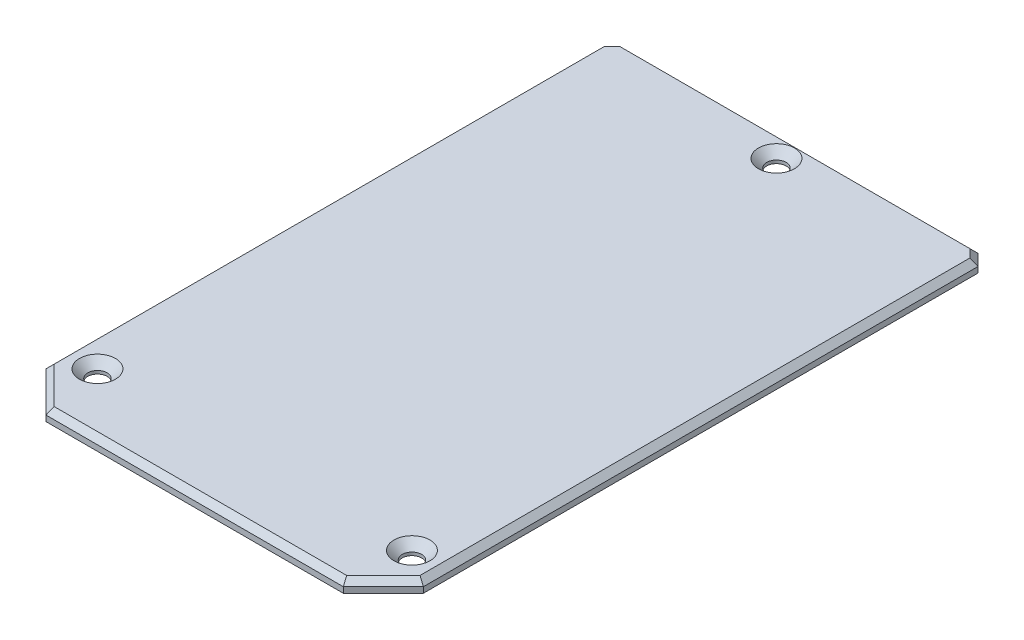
from build123d import *

# Parameters (mm, degrees)
BOSS_EXTRUDE1_DEPTH                            = 2
CHAMFER1_SIZE                                  = 2
CSK_FOR_M3_FLAT_HEAD_MACHINE_SCREW2_AT_2_COUNT = 2
CSK_FOR_M3_FLAT_HEAD_MACHINE_SCREW2_AT_2_PITCH = 54.999999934
CHAMFER2_SIZE                                  = 1


with BuildPart() as part:
    # Sketch1 → Boss-Extrude1 (new body)
    with BuildSketch(Plane(origin=(0, 0, 0), x_dir=(1, 0, 0), z_dir=(0, 1, 0))):
        Polygon((-32.999999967, -45.999999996), (-25.999999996, -52.999999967), (25.999999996, -52.999999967), (32.999999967, -45.999999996), (32.999999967, 53), (-32.999999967, 53), align=None)
    extrude(amount=BOSS_EXTRUDE1_DEPTH)

    # Chamfer1
    chamfer1_edges = [part.edges().sort_by_distance(p)[0] for p in [
        (-32.999999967, 1, -53),
        (32.999999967, 1, -53),
    ]]
    chamfer(chamfer1_edges, length=CHAMFER1_SIZE)

    # Sketch4 → CSK for M3 Flat Head Machine Screw1 (revolve, cut)
    with BuildSketch(Plane(origin=(3.3e-08, 2, -48.75), x_dir=(0, 0, 1), z_dir=(1, 0, 0))):
        Polygon((0, 0), (0, 2), (1.7, 2), (1.7, 1.45), (3.15, 0), align=None)
    revolve(axis=Axis((3.3e-08, 8.35, -48.75), (0, -1, 0)), mode=Mode.SUBTRACT)

    # Sketch6 → CSK for M3 Flat Head Machine Screw2 (revolve, cut)
    with BuildSketch(Plane(origin=(-27.499999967, 2, 42.5), x_dir=(0, 0, 1), z_dir=(1, 0, 0))):
        Polygon((0, 0), (0, 2), (1.7, 2), (1.7, 1.45), (3.15, 0), align=None)
    csk_for_m3_flat_head_machine_screw2 = revolve(axis=Axis((-27.499999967, 8.35, 42.5), (0, -1, 0)), mode=Mode.SUBTRACT)

    # CSK for M3 Flat Head Machine Screw2 at 2: CSK for M3 Flat Head Machine Screw2 ×2
    with Locations(*[(i * CSK_FOR_M3_FLAT_HEAD_MACHINE_SCREW2_AT_2_PITCH, 0, 0) for i in range(1, CSK_FOR_M3_FLAT_HEAD_MACHINE_SCREW2_AT_2_COUNT)]):
        add(csk_for_m3_flat_head_machine_screw2, mode=Mode.SUBTRACT)

    # Chamfer2
    chamfer2_edges = [part.edges().sort_by_distance(p)[0] for p in [
        (-29.499999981, 2, 49.499999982),
        (0, 2, 52.999999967),
        (29.499999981, 2, 49.499999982),
        (0, 2, -53),
        (-32.999999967, 2, -2.500000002),
        (-31.999999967, 2, -52),
        (31.999999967, 2, -52),
        (32.999999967, 2, -2.500000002),
    ]]
    chamfer(chamfer2_edges, length=CHAMFER2_SIZE)


solid = part.part
